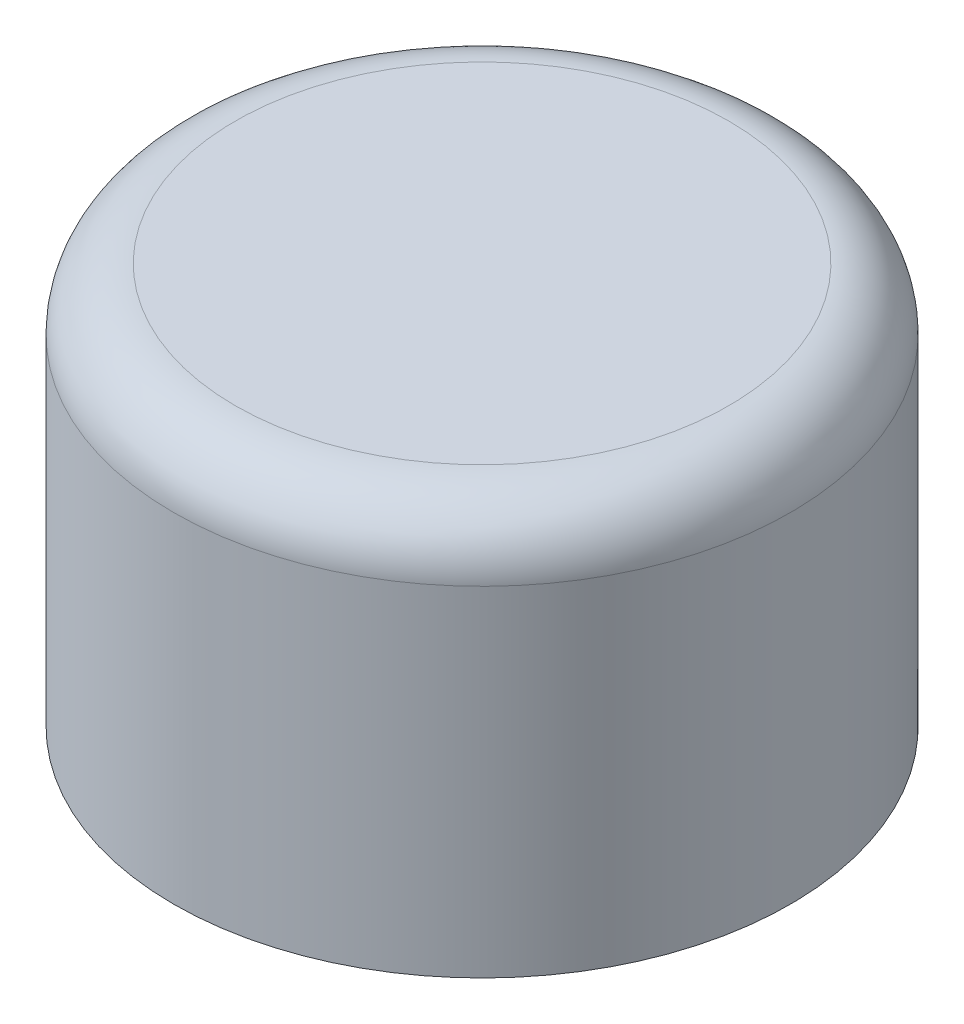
ISO-10303-21;
HEADER;
FILE_DESCRIPTION(('STEP AP214'),'2;1');
FILE_NAME('part.step','',(''),(''),'','','');
FILE_SCHEMA(('AUTOMOTIVE_DESIGN { 1 0 10303 214 1 1 1 1 }'));
ENDSEC;
DATA;
#1=APPLICATION_CONTEXT('core data for automotive mechanical design processes');
#2=APPLICATION_PROTOCOL_DEFINITION('international standard','automotive_design',2000,#1);
#3=PRODUCT_CONTEXT('',#1,'mechanical');
#4=PRODUCT('Part','Part','',(#3));
#5=PRODUCT_RELATED_PRODUCT_CATEGORY('part','',(#4));
#6=PRODUCT_DEFINITION_FORMATION('','',#4);
#7=PRODUCT_DEFINITION_CONTEXT('part definition',#1,'design');
#8=PRODUCT_DEFINITION('design','',#6,#7);
#9=PRODUCT_DEFINITION_SHAPE('','',#8);
#10=(LENGTH_UNIT() NAMED_UNIT(*) SI_UNIT(.MILLI.,.METRE.));
#11=(NAMED_UNIT(*) PLANE_ANGLE_UNIT() SI_UNIT($,.RADIAN.));
#12=(NAMED_UNIT(*) SI_UNIT($,.STERADIAN.) SOLID_ANGLE_UNIT());
#13=UNCERTAINTY_MEASURE_WITH_UNIT(LENGTH_MEASURE(1.E-05),#10,'distance_accuracy_value','');
#14=(GEOMETRIC_REPRESENTATION_CONTEXT(3) GLOBAL_UNCERTAINTY_ASSIGNED_CONTEXT((#13)) GLOBAL_UNIT_ASSIGNED_CONTEXT((#10,
#11,#12)) REPRESENTATION_CONTEXT('',''));
#15=CARTESIAN_POINT('',(0.,0.,0.));
#16=DIRECTION('',(0.,0.,1.));
#17=DIRECTION('',(1.,0.,0.));
#18=AXIS2_PLACEMENT_3D('',#15,#16,#17);
#19=CARTESIAN_POINT('',(0.,13.,0.));
#20=DIRECTION('',(0.,-1.,0.));
#21=DIRECTION('',(0.,0.,-1.));
#22=AXIS2_PLACEMENT_3D('',#19,#20,#21);
#23=CYLINDRICAL_SURFACE('',#22,10.);
#24=CARTESIAN_POINT('',(0.,11.,0.));
#25=DIRECTION('',(0.,1.,0.));
#26=DIRECTION('',(0.,0.,1.));
#27=AXIS2_PLACEMENT_3D('',#24,#25,#26);
#28=CIRCLE('',#27,10.);
#29=CARTESIAN_POINT('',(0.,11.,10.));
#30=VERTEX_POINT('',#29);
#31=EDGE_CURVE('E10',#30,#30,#28,.F.);
#32=ORIENTED_EDGE('',*,*,#31,.T.);
#33=EDGE_LOOP('',(#32));
#34=FACE_BOUND('',#33,.T.);
#35=CARTESIAN_POINT('',(0.,0.,0.));
#36=DIRECTION('',(0.,1.,0.));
#37=DIRECTION('',(0.,0.,1.));
#38=AXIS2_PLACEMENT_3D('',#35,#36,#37);
#39=CIRCLE('',#38,10.);
#40=CARTESIAN_POINT('',(0.,0.,10.));
#41=VERTEX_POINT('',#40);
#42=EDGE_CURVE('E42',#41,#41,#39,.T.);
#43=ORIENTED_EDGE('',*,*,#42,.T.);
#44=EDGE_LOOP('',(#43));
#45=FACE_BOUND('',#44,.T.);
#46=ADVANCED_FACE('F31',(#34,#45),#23,.T.);
#47=CARTESIAN_POINT('',(0.,13.,0.));
#48=DIRECTION('',(0.,1.,0.));
#49=DIRECTION('',(0.,0.,1.));
#50=AXIS2_PLACEMENT_3D('',#47,#48,#49);
#51=PLANE('',#50);
#52=CARTESIAN_POINT('',(0.,13.,0.));
#53=DIRECTION('',(0.,1.,0.));
#54=DIRECTION('',(0.,0.,1.));
#55=AXIS2_PLACEMENT_3D('',#52,#53,#54);
#56=CIRCLE('',#55,8.);
#57=CARTESIAN_POINT('',(0.,13.,8.));
#58=VERTEX_POINT('',#57);
#59=EDGE_CURVE('E38',#58,#58,#56,.T.);
#60=ORIENTED_EDGE('',*,*,#59,.T.);
#61=EDGE_LOOP('',(#60));
#62=FACE_BOUND('',#61,.T.);
#63=ADVANCED_FACE('F52',(#62),#51,.T.);
#64=CARTESIAN_POINT('',(0.,0.,0.));
#65=DIRECTION('',(0.,1.,0.));
#66=DIRECTION('',(0.,0.,1.));
#67=AXIS2_PLACEMENT_3D('',#64,#65,#66);
#68=PLANE('',#67);
#69=ORIENTED_EDGE('',*,*,#42,.F.);
#70=EDGE_LOOP('',(#69));
#71=FACE_BOUND('',#70,.T.);
#72=ADVANCED_FACE('F50',(#71),#68,.F.);
#73=CARTESIAN_POINT('',(0.,11.,0.));
#74=DIRECTION('',(0.,1.,0.));
#75=DIRECTION('',(0.,0.,1.));
#76=AXIS2_PLACEMENT_3D('',#73,#74,#75);
#77=TOROIDAL_SURFACE('',#76,8.,2.);
#78=ORIENTED_EDGE('',*,*,#31,.F.);
#79=EDGE_LOOP('',(#78));
#80=FACE_BOUND('',#79,.T.);
#81=ORIENTED_EDGE('',*,*,#59,.F.);
#82=EDGE_LOOP('',(#81));
#83=FACE_BOUND('',#82,.T.);
#84=ADVANCED_FACE('F33',(#80,#83),#77,.T.);
#85=CLOSED_SHELL('',(#46,#63,#72,#84));
#86=MANIFOLD_SOLID_BREP('B2',#85);
#87=ADVANCED_BREP_SHAPE_REPRESENTATION('',(#18,#86),#14);
#88=SHAPE_DEFINITION_REPRESENTATION(#9,#87);
ENDSEC;
END-ISO-10303-21;
